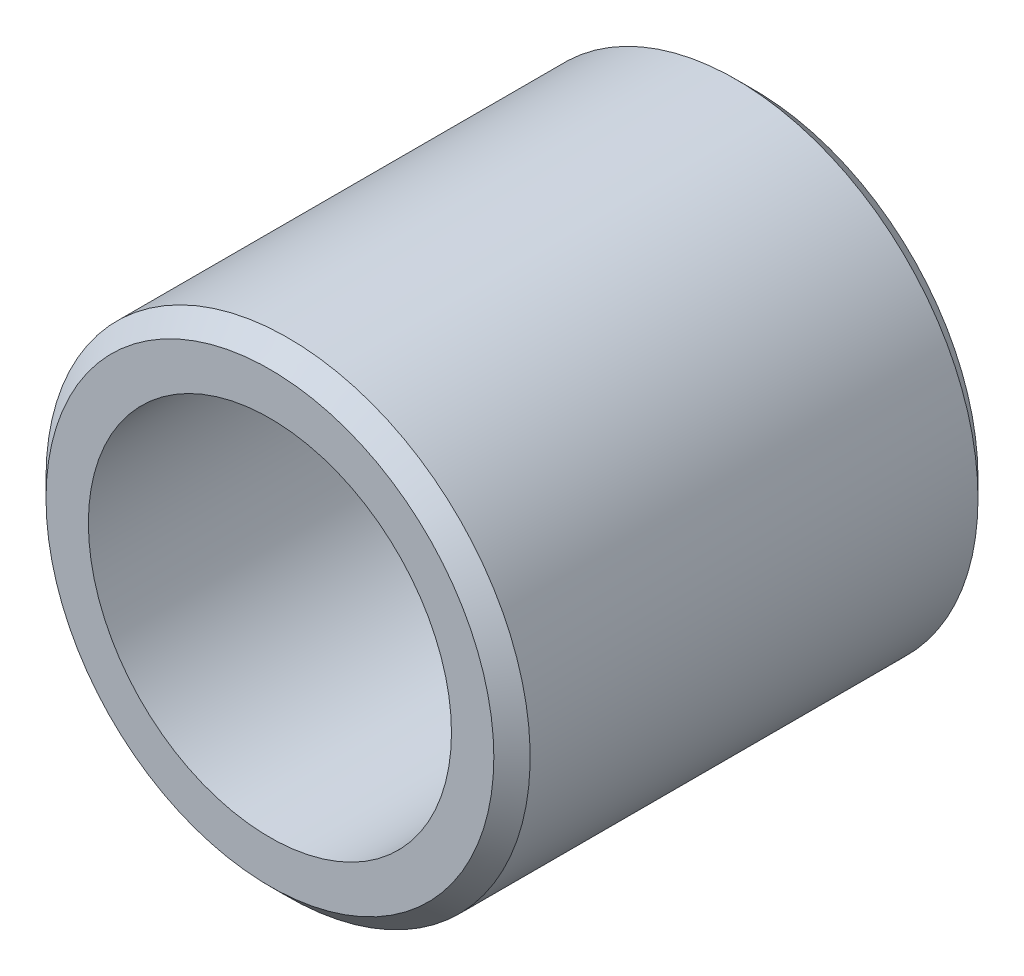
from build123d import *

# Parameters (mm, degrees)
ESQUISSE1_R             = 4
EXTRUSION1_DEPTH        = 8
CHANFREIN1_SIZE         = 0.3
ESQUISSE2_R             = 3
ENL_V_MAT_EXTRU_1_DEPTH = 7
ESQUISSE3_R             = 2.5
ENL_V_MAT_EXTRU_2_DEPTH = 10.797958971


with BuildPart() as part:
    # Esquisse1 → Extrusion1 (new body)
    with BuildSketch(Plane.XY):
        Circle(ESQUISSE1_R)
    extrude(amount=EXTRUSION1_DEPTH)

    # Chanfrein1
    chanfrein1_edges = [part.edges().sort_by_distance(p)[0] for p in [
        (-4, 0, 0),
        (-4, 0, 8),
    ]]
    chamfer(chanfrein1_edges, length=CHANFREIN1_SIZE)

    # Esquisse2 → Enl_v. mat.-Extru.1 (cut)
    with BuildSketch(Plane.XY.offset(8)):
        Circle(ESQUISSE2_R)
    extrude(amount=-ENL_V_MAT_EXTRU_1_DEPTH, mode=Mode.SUBTRACT)

    # Esquisse3 → Enl_v. mat.-Extru.2 (cut, through all)
    with BuildSketch(Plane(origin=(0, 0, 0), x_dir=(-1, 0, 0), z_dir=(0, 0, -1))):
        Circle(ESQUISSE3_R)
    extrude(amount=-ENL_V_MAT_EXTRU_2_DEPTH, mode=Mode.SUBTRACT)


solid = part.part
